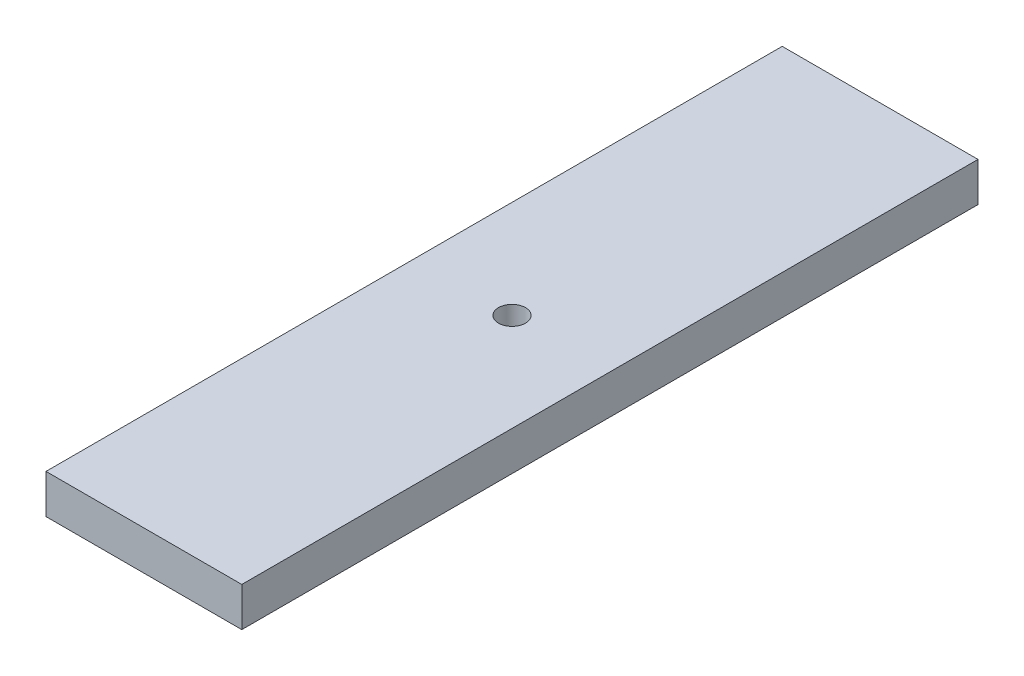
ISO-10303-21;
HEADER;
FILE_DESCRIPTION(('STEP AP214'),'2;1');
FILE_NAME('part.step','',(''),(''),'','','');
FILE_SCHEMA(('AUTOMOTIVE_DESIGN { 1 0 10303 214 1 1 1 1 }'));
ENDSEC;
DATA;
#1=APPLICATION_CONTEXT('core data for automotive mechanical design processes');
#2=APPLICATION_PROTOCOL_DEFINITION('international standard','automotive_design',2000,#1);
#3=PRODUCT_CONTEXT('',#1,'mechanical');
#4=PRODUCT('Part','Part','',(#3));
#5=PRODUCT_RELATED_PRODUCT_CATEGORY('part','',(#4));
#6=PRODUCT_DEFINITION_FORMATION('','',#4);
#7=PRODUCT_DEFINITION_CONTEXT('part definition',#1,'design');
#8=PRODUCT_DEFINITION('design','',#6,#7);
#9=PRODUCT_DEFINITION_SHAPE('','',#8);
#10=(LENGTH_UNIT() NAMED_UNIT(*) SI_UNIT(.MILLI.,.METRE.));
#11=(NAMED_UNIT(*) PLANE_ANGLE_UNIT() SI_UNIT($,.RADIAN.));
#12=(NAMED_UNIT(*) SI_UNIT($,.STERADIAN.) SOLID_ANGLE_UNIT());
#13=UNCERTAINTY_MEASURE_WITH_UNIT(LENGTH_MEASURE(1.E-05),#10,'distance_accuracy_value','');
#14=(GEOMETRIC_REPRESENTATION_CONTEXT(3) GLOBAL_UNCERTAINTY_ASSIGNED_CONTEXT((#13)) GLOBAL_UNIT_ASSIGNED_CONTEXT((#10,
#11,#12)) REPRESENTATION_CONTEXT('',''));
#15=CARTESIAN_POINT('',(0.,0.,0.));
#16=DIRECTION('',(0.,0.,1.));
#17=DIRECTION('',(1.,0.,0.));
#18=AXIS2_PLACEMENT_3D('',#15,#16,#17);
#19=CARTESIAN_POINT('',(25.0000000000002,-5.0000000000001,94.0000000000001));
#20=DIRECTION('',(-1.,0.,0.));
#21=DIRECTION('',(0.,0.,1.));
#22=AXIS2_PLACEMENT_3D('',#19,#20,#21);
#23=PLANE('',#22);
#24=DIRECTION('',(0.,1.,0.));
#25=VECTOR('',#24,1.);
#26=CARTESIAN_POINT('',(25.0000000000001,-5.0000000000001,-93.9999999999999));
#27=LINE('',#26,#25);
#28=CARTESIAN_POINT('',(25.0000000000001,-5.0000000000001,-93.9999999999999));
#29=VERTEX_POINT('',#28);
#30=CARTESIAN_POINT('',(25.,4.99999999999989,-93.9999999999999));
#31=VERTEX_POINT('',#30);
#32=EDGE_CURVE('E72',#29,#31,#27,.T.);
#33=ORIENTED_EDGE('',*,*,#32,.T.);
#34=DIRECTION('',(0.,0.,-1.));
#35=VECTOR('',#34,1.);
#36=CARTESIAN_POINT('',(25.0000000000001,4.99999999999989,94.0000000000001));
#37=LINE('',#36,#35);
#38=CARTESIAN_POINT('',(25.0000000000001,4.99999999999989,94.0000000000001));
#39=VERTEX_POINT('',#38);
#40=EDGE_CURVE('E11',#39,#31,#37,.T.);
#41=ORIENTED_EDGE('',*,*,#40,.F.);
#42=DIRECTION('',(0.,1.,0.));
#43=VECTOR('',#42,1.);
#44=CARTESIAN_POINT('',(25.0000000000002,-5.0000000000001,94.0000000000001));
#45=LINE('',#44,#43);
#46=CARTESIAN_POINT('',(25.0000000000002,-5.0000000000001,94.0000000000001));
#47=VERTEX_POINT('',#46);
#48=EDGE_CURVE('E95',#47,#39,#45,.T.);
#49=ORIENTED_EDGE('',*,*,#48,.F.);
#50=DIRECTION('',(0.,0.,-1.));
#51=VECTOR('',#50,1.);
#52=CARTESIAN_POINT('',(25.0000000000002,-5.0000000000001,94.0000000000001));
#53=LINE('',#52,#51);
#54=EDGE_CURVE('E84',#47,#29,#53,.T.);
#55=ORIENTED_EDGE('',*,*,#54,.T.);
#56=EDGE_LOOP('',(#33,#41,#49,#55));
#57=FACE_BOUND('',#56,.T.);
#58=ADVANCED_FACE('F28',(#57),#23,.F.);
#59=CARTESIAN_POINT('',(25.0000000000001,4.99999999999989,94.0000000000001));
#60=DIRECTION('',(0.,-1.,0.));
#61=DIRECTION('',(1.,0.,0.));
#62=AXIS2_PLACEMENT_3D('',#59,#60,#61);
#63=PLANE('',#62);
#64=CARTESIAN_POINT('',(1.11022302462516E-13,5.,0.));
#65=DIRECTION('',(0.,1.,0.));
#66=DIRECTION('',(-1.,0.,0.));
#67=AXIS2_PLACEMENT_3D('',#64,#65,#66);
#68=CIRCLE('',#67,3.45);
#69=CARTESIAN_POINT('',(-3.44999999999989,5.,0.));
#70=VERTEX_POINT('',#69);
#71=EDGE_CURVE('E88',#70,#70,#68,.T.);
#72=ORIENTED_EDGE('',*,*,#71,.F.);
#73=EDGE_LOOP('',(#72));
#74=FACE_BOUND('',#73,.T.);
#75=DIRECTION('',(-1.,0.,0.));
#76=VECTOR('',#75,1.);
#77=CARTESIAN_POINT('',(25.,4.99999999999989,-93.9999999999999));
#78=LINE('',#77,#76);
#79=CARTESIAN_POINT('',(-25.,4.99999999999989,-94.));
#80=VERTEX_POINT('',#79);
#81=EDGE_CURVE('E68',#31,#80,#78,.T.);
#82=ORIENTED_EDGE('',*,*,#81,.T.);
#83=DIRECTION('',(0.,0.,-1.));
#84=VECTOR('',#83,1.);
#85=CARTESIAN_POINT('',(-24.9999999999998,4.99999999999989,94.));
#86=LINE('',#85,#84);
#87=CARTESIAN_POINT('',(-24.9999999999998,4.99999999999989,94.));
#88=VERTEX_POINT('',#87);
#89=EDGE_CURVE('E35',#88,#80,#86,.T.);
#90=ORIENTED_EDGE('',*,*,#89,.F.);
#91=DIRECTION('',(-1.,0.,0.));
#92=VECTOR('',#91,1.);
#93=CARTESIAN_POINT('',(25.0000000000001,4.99999999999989,94.0000000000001));
#94=LINE('',#93,#92);
#95=EDGE_CURVE('E80',#39,#88,#94,.T.);
#96=ORIENTED_EDGE('',*,*,#95,.F.);
#97=ORIENTED_EDGE('',*,*,#40,.T.);
#98=EDGE_LOOP('',(#82,#90,#96,#97));
#99=FACE_BOUND('',#98,.T.);
#100=ADVANCED_FACE('F79',(#74,#99),#63,.F.);
#101=CARTESIAN_POINT('',(-24.9999999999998,-5.0000000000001,94.));
#102=DIRECTION('',(1.,0.,0.));
#103=DIRECTION('',(0.,0.,-1.));
#104=AXIS2_PLACEMENT_3D('',#101,#102,#103);
#105=PLANE('',#104);
#106=DIRECTION('',(0.,-1.,0.));
#107=VECTOR('',#106,1.);
#108=CARTESIAN_POINT('',(-25.0000000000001,-5.0000000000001,-94.));
#109=LINE('',#108,#107);
#110=CARTESIAN_POINT('',(-25.0000000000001,-5.0000000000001,-94.));
#111=VERTEX_POINT('',#110);
#112=EDGE_CURVE('E73',#80,#111,#109,.T.);
#113=ORIENTED_EDGE('',*,*,#112,.T.);
#114=DIRECTION('',(0.,0.,-1.));
#115=VECTOR('',#114,1.);
#116=CARTESIAN_POINT('',(-24.9999999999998,-5.0000000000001,94.));
#117=LINE('',#116,#115);
#118=CARTESIAN_POINT('',(-24.9999999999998,-5.0000000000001,94.));
#119=VERTEX_POINT('',#118);
#120=EDGE_CURVE('E101',#119,#111,#117,.T.);
#121=ORIENTED_EDGE('',*,*,#120,.F.);
#122=DIRECTION('',(0.,-1.,0.));
#123=VECTOR('',#122,1.);
#124=CARTESIAN_POINT('',(-24.9999999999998,-5.0000000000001,94.));
#125=LINE('',#124,#123);
#126=EDGE_CURVE('E47',#88,#119,#125,.T.);
#127=ORIENTED_EDGE('',*,*,#126,.F.);
#128=ORIENTED_EDGE('',*,*,#89,.T.);
#129=EDGE_LOOP('',(#113,#121,#127,#128));
#130=FACE_BOUND('',#129,.T.);
#131=ADVANCED_FACE('F104',(#130),#105,.F.);
#132=CARTESIAN_POINT('',(25.0000000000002,-5.0000000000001,94.0000000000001));
#133=DIRECTION('',(0.,1.,0.));
#134=DIRECTION('',(-1.,0.,0.));
#135=AXIS2_PLACEMENT_3D('',#132,#133,#134);
#136=PLANE('',#135);
#137=CARTESIAN_POINT('',(1.11022302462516E-13,-5.00000000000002,0.));
#138=DIRECTION('',(0.,1.,0.));
#139=DIRECTION('',(-1.,0.,0.));
#140=AXIS2_PLACEMENT_3D('',#137,#138,#139);
#141=CIRCLE('',#140,3.45);
#142=CARTESIAN_POINT('',(-3.44999999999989,-5.00000000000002,0.));
#143=VERTEX_POINT('',#142);
#144=EDGE_CURVE('E85',#143,#143,#141,.T.);
#145=ORIENTED_EDGE('',*,*,#144,.T.);
#146=EDGE_LOOP('',(#145));
#147=FACE_BOUND('',#146,.T.);
#148=DIRECTION('',(1.,0.,0.));
#149=VECTOR('',#148,1.);
#150=CARTESIAN_POINT('',(25.0000000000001,-5.0000000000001,-93.9999999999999));
#151=LINE('',#150,#149);
#152=EDGE_CURVE('E93',#111,#29,#151,.T.);
#153=ORIENTED_EDGE('',*,*,#152,.T.);
#154=ORIENTED_EDGE('',*,*,#54,.F.);
#155=DIRECTION('',(1.,0.,0.));
#156=VECTOR('',#155,1.);
#157=CARTESIAN_POINT('',(25.0000000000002,-5.0000000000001,94.0000000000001));
#158=LINE('',#157,#156);
#159=EDGE_CURVE('E42',#119,#47,#158,.T.);
#160=ORIENTED_EDGE('',*,*,#159,.F.);
#161=ORIENTED_EDGE('',*,*,#120,.T.);
#162=EDGE_LOOP('',(#153,#154,#160,#161));
#163=FACE_BOUND('',#162,.T.);
#164=ADVANCED_FACE('F106',(#147,#163),#136,.F.);
#165=CARTESIAN_POINT('',(25.0000000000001,4.99999999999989,94.0000000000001));
#166=DIRECTION('',(0.,0.,1.));
#167=DIRECTION('',(1.,0.,0.));
#168=AXIS2_PLACEMENT_3D('',#165,#166,#167);
#169=PLANE('',#168);
#170=ORIENTED_EDGE('',*,*,#48,.T.);
#171=ORIENTED_EDGE('',*,*,#95,.T.);
#172=ORIENTED_EDGE('',*,*,#126,.T.);
#173=ORIENTED_EDGE('',*,*,#159,.T.);
#174=EDGE_LOOP('',(#170,#171,#172,#173));
#175=FACE_BOUND('',#174,.T.);
#176=ADVANCED_FACE('F107',(#175),#169,.T.);
#177=CARTESIAN_POINT('',(25.,4.99999999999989,-93.9999999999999));
#178=DIRECTION('',(0.,0.,1.));
#179=DIRECTION('',(1.,0.,0.));
#180=AXIS2_PLACEMENT_3D('',#177,#178,#179);
#181=PLANE('',#180);
#182=ORIENTED_EDGE('',*,*,#32,.F.);
#183=ORIENTED_EDGE('',*,*,#152,.F.);
#184=ORIENTED_EDGE('',*,*,#112,.F.);
#185=ORIENTED_EDGE('',*,*,#81,.F.);
#186=EDGE_LOOP('',(#182,#183,#184,#185));
#187=FACE_BOUND('',#186,.T.);
#188=ADVANCED_FACE('F69',(#187),#181,.F.);
#189=CARTESIAN_POINT('',(1.11022302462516E-13,-5.00000000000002,0.));
#190=DIRECTION('',(0.,1.,0.));
#191=DIRECTION('',(-1.,0.,0.));
#192=AXIS2_PLACEMENT_3D('',#189,#190,#191);
#193=CYLINDRICAL_SURFACE('',#192,3.45);
#194=ORIENTED_EDGE('',*,*,#144,.F.);
#195=EDGE_LOOP('',(#194));
#196=FACE_BOUND('',#195,.T.);
#197=ORIENTED_EDGE('',*,*,#71,.T.);
#198=EDGE_LOOP('',(#197));
#199=FACE_BOUND('',#198,.T.);
#200=ADVANCED_FACE('F114',(#196,#199),#193,.F.);
#201=CLOSED_SHELL('',(#58,#100,#131,#164,#176,#188,#200));
#202=MANIFOLD_SOLID_BREP('B2',#201);
#203=ADVANCED_BREP_SHAPE_REPRESENTATION('',(#18,#202),#14);
#204=SHAPE_DEFINITION_REPRESENTATION(#9,#203);
ENDSEC;
END-ISO-10303-21;
